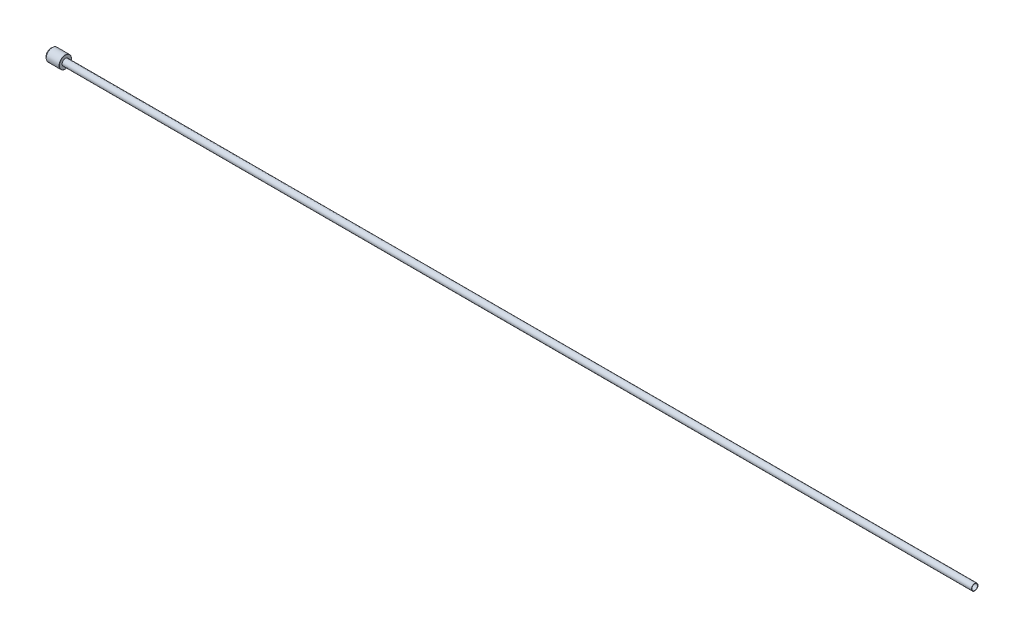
ISO-10303-21;
HEADER;
FILE_DESCRIPTION(('STEP AP214'),'2;1');
FILE_NAME('part.step','',(''),(''),'','','');
FILE_SCHEMA(('AUTOMOTIVE_DESIGN { 1 0 10303 214 1 1 1 1 }'));
ENDSEC;
DATA;
#1=APPLICATION_CONTEXT('core data for automotive mechanical design processes');
#2=APPLICATION_PROTOCOL_DEFINITION('international standard','automotive_design',2000,#1);
#3=PRODUCT_CONTEXT('',#1,'mechanical');
#4=PRODUCT('Part','Part','',(#3));
#5=PRODUCT_RELATED_PRODUCT_CATEGORY('part','',(#4));
#6=PRODUCT_DEFINITION_FORMATION('','',#4);
#7=PRODUCT_DEFINITION_CONTEXT('part definition',#1,'design');
#8=PRODUCT_DEFINITION('design','',#6,#7);
#9=PRODUCT_DEFINITION_SHAPE('','',#8);
#10=(LENGTH_UNIT() NAMED_UNIT(*) SI_UNIT(.MILLI.,.METRE.));
#11=(NAMED_UNIT(*) PLANE_ANGLE_UNIT() SI_UNIT($,.RADIAN.));
#12=(NAMED_UNIT(*) SI_UNIT($,.STERADIAN.) SOLID_ANGLE_UNIT());
#13=UNCERTAINTY_MEASURE_WITH_UNIT(LENGTH_MEASURE(1.E-05),#10,'distance_accuracy_value','');
#14=(GEOMETRIC_REPRESENTATION_CONTEXT(3) GLOBAL_UNCERTAINTY_ASSIGNED_CONTEXT((#13)) GLOBAL_UNIT_ASSIGNED_CONTEXT((#10,
#11,#12)) REPRESENTATION_CONTEXT('',''));
#15=CARTESIAN_POINT('',(0.,0.,0.));
#16=DIRECTION('',(0.,0.,1.));
#17=DIRECTION('',(1.,0.,0.));
#18=AXIS2_PLACEMENT_3D('',#15,#16,#17);
#19=CARTESIAN_POINT('',(7.,3.,0.));
#20=DIRECTION('',(-1.,0.,0.));
#21=DIRECTION('',(0.,0.,1.));
#22=AXIS2_PLACEMENT_3D('',#19,#20,#21);
#23=PLANE('',#22);
#24=CARTESIAN_POINT('',(7.,0.,0.));
#25=DIRECTION('',(-1.,0.,0.));
#26=DIRECTION('',(0.,0.,1.));
#27=AXIS2_PLACEMENT_3D('',#24,#25,#26);
#28=CIRCLE('',#27,2.9);
#29=CARTESIAN_POINT('',(7.,0.,2.9));
#30=VERTEX_POINT('',#29);
#31=EDGE_CURVE('E10',#30,#30,#28,.F.);
#32=ORIENTED_EDGE('',*,*,#31,.T.);
#33=EDGE_LOOP('',(#32));
#34=FACE_BOUND('',#33,.T.);
#35=CARTESIAN_POINT('',(7.,0.,0.));
#36=DIRECTION('',(-1.,0.,0.));
#37=DIRECTION('',(0.,0.,1.));
#38=AXIS2_PLACEMENT_3D('',#35,#36,#37);
#39=CIRCLE('',#38,1.5875);
#40=CARTESIAN_POINT('',(7.,0.,1.5875));
#41=VERTEX_POINT('',#40);
#42=EDGE_CURVE('E63',#41,#41,#39,.T.);
#43=ORIENTED_EDGE('',*,*,#42,.T.);
#44=EDGE_LOOP('',(#43));
#45=FACE_BOUND('',#44,.T.);
#46=ADVANCED_FACE('F31',(#34,#45),#23,.F.);
#47=CARTESIAN_POINT('',(-22.2121854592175,0.,0.));
#48=DIRECTION('',(-1.,0.,0.));
#49=DIRECTION('',(0.,0.,1.));
#50=AXIS2_PLACEMENT_3D('',#47,#48,#49);
#51=CYLINDRICAL_SURFACE('',#50,3.);
#52=CARTESIAN_POINT('',(6.9,0.,0.));
#53=DIRECTION('',(-1.,0.,0.));
#54=DIRECTION('',(0.,0.,1.));
#55=AXIS2_PLACEMENT_3D('',#52,#53,#54);
#56=CIRCLE('',#55,3.);
#57=CARTESIAN_POINT('',(6.9,0.,3.));
#58=VERTEX_POINT('',#57);
#59=EDGE_CURVE('E38',#58,#58,#56,.T.);
#60=ORIENTED_EDGE('',*,*,#59,.T.);
#61=EDGE_LOOP('',(#60));
#62=FACE_BOUND('',#61,.T.);
#63=CARTESIAN_POINT('',(0.659999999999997,0.,0.));
#64=DIRECTION('',(-1.,0.,0.));
#65=DIRECTION('',(0.,0.,1.));
#66=AXIS2_PLACEMENT_3D('',#63,#64,#65);
#67=CIRCLE('',#66,3.);
#68=CARTESIAN_POINT('',(0.659999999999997,0.,3.));
#69=VERTEX_POINT('',#68);
#70=EDGE_CURVE('E42',#69,#69,#67,.T.);
#71=ORIENTED_EDGE('',*,*,#70,.F.);
#72=EDGE_LOOP('',(#71));
#73=FACE_BOUND('',#72,.T.);
#74=ADVANCED_FACE('F101',(#62,#73),#51,.T.);
#75=CARTESIAN_POINT('',(0.659999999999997,0.,0.));
#76=DIRECTION('',(1.,0.,0.));
#77=DIRECTION('',(0.,0.,-1.));
#78=AXIS2_PLACEMENT_3D('',#75,#76,#77);
#79=CONICAL_SURFACE('',#78,3.,0.78539816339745);
#80=CARTESIAN_POINT('',(0.0999999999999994,0.,0.));
#81=DIRECTION('',(-1.,0.,0.));
#82=DIRECTION('',(0.,0.,1.));
#83=AXIS2_PLACEMENT_3D('',#80,#81,#82);
#84=CIRCLE('',#83,2.44);
#85=CARTESIAN_POINT('',(0.0999999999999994,0.,2.44));
#86=VERTEX_POINT('',#85);
#87=EDGE_CURVE('E46',#86,#86,#84,.T.);
#88=ORIENTED_EDGE('',*,*,#87,.F.);
#89=EDGE_LOOP('',(#88));
#90=FACE_BOUND('',#89,.T.);
#91=ORIENTED_EDGE('',*,*,#70,.T.);
#92=EDGE_LOOP('',(#91));
#93=FACE_BOUND('',#92,.T.);
#94=ADVANCED_FACE('F95',(#90,#93),#79,.T.);
#95=CARTESIAN_POINT('',(-22.2121854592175,0.,0.));
#96=DIRECTION('',(-1.,0.,0.));
#97=DIRECTION('',(0.,0.,1.));
#98=AXIS2_PLACEMENT_3D('',#95,#96,#97);
#99=CYLINDRICAL_SURFACE('',#98,2.44);
#100=CARTESIAN_POINT('',(0.,0.,0.));
#101=DIRECTION('',(-1.,0.,0.));
#102=DIRECTION('',(0.,0.,1.));
#103=AXIS2_PLACEMENT_3D('',#100,#101,#102);
#104=CIRCLE('',#103,2.44);
#105=CARTESIAN_POINT('',(0.,0.,2.44));
#106=VERTEX_POINT('',#105);
#107=EDGE_CURVE('E51',#106,#106,#104,.T.);
#108=ORIENTED_EDGE('',*,*,#107,.F.);
#109=EDGE_LOOP('',(#108));
#110=FACE_BOUND('',#109,.T.);
#111=ORIENTED_EDGE('',*,*,#87,.T.);
#112=EDGE_LOOP('',(#111));
#113=FACE_BOUND('',#112,.T.);
#114=ADVANCED_FACE('F89',(#110,#113),#99,.T.);
#115=CARTESIAN_POINT('',(0.,1.3843,0.));
#116=DIRECTION('',(1.,0.,0.));
#117=DIRECTION('',(0.,0.,-1.));
#118=AXIS2_PLACEMENT_3D('',#115,#116,#117);
#119=PLANE('',#118);
#120=CARTESIAN_POINT('',(0.,0.,0.));
#121=DIRECTION('',(-1.,0.,0.));
#122=DIRECTION('',(0.,0.,1.));
#123=AXIS2_PLACEMENT_3D('',#120,#121,#122);
#124=CIRCLE('',#123,1.3843);
#125=CARTESIAN_POINT('',(0.,0.,1.3843));
#126=VERTEX_POINT('',#125);
#127=EDGE_CURVE('E54',#126,#126,#124,.T.);
#128=ORIENTED_EDGE('',*,*,#127,.F.);
#129=EDGE_LOOP('',(#128));
#130=FACE_BOUND('',#129,.T.);
#131=ORIENTED_EDGE('',*,*,#107,.T.);
#132=EDGE_LOOP('',(#131));
#133=FACE_BOUND('',#132,.T.);
#134=ADVANCED_FACE('F83',(#130,#133),#119,.F.);
#135=CARTESIAN_POINT('',(-22.2121854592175,0.,0.));
#136=DIRECTION('',(-1.,0.,0.));
#137=DIRECTION('',(0.,0.,1.));
#138=AXIS2_PLACEMENT_3D('',#135,#136,#137);
#139=CYLINDRICAL_SURFACE('',#138,1.38430000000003);
#140=CARTESIAN_POINT('',(450.,0.,0.));
#141=DIRECTION('',(-1.,0.,0.));
#142=DIRECTION('',(0.,0.,1.));
#143=AXIS2_PLACEMENT_3D('',#140,#141,#142);
#144=CIRCLE('',#143,1.38430000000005);
#145=CARTESIAN_POINT('',(450.,0.,1.38430000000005));
#146=VERTEX_POINT('',#145);
#147=EDGE_CURVE('E57',#146,#146,#144,.T.);
#148=ORIENTED_EDGE('',*,*,#147,.F.);
#149=EDGE_LOOP('',(#148));
#150=FACE_BOUND('',#149,.T.);
#151=ORIENTED_EDGE('',*,*,#127,.T.);
#152=EDGE_LOOP('',(#151));
#153=FACE_BOUND('',#152,.T.);
#154=ADVANCED_FACE('F77',(#150,#153),#139,.F.);
#155=CARTESIAN_POINT('',(450.,1.5875,0.));
#156=DIRECTION('',(-1.,0.,0.));
#157=DIRECTION('',(0.,0.,1.));
#158=AXIS2_PLACEMENT_3D('',#155,#156,#157);
#159=PLANE('',#158);
#160=CARTESIAN_POINT('',(450.,0.,0.));
#161=DIRECTION('',(-1.,0.,0.));
#162=DIRECTION('',(0.,0.,1.));
#163=AXIS2_PLACEMENT_3D('',#160,#161,#162);
#164=CIRCLE('',#163,1.5875);
#165=CARTESIAN_POINT('',(450.,0.,1.5875));
#166=VERTEX_POINT('',#165);
#167=EDGE_CURVE('E60',#166,#166,#164,.T.);
#168=ORIENTED_EDGE('',*,*,#167,.F.);
#169=EDGE_LOOP('',(#168));
#170=FACE_BOUND('',#169,.T.);
#171=ORIENTED_EDGE('',*,*,#147,.T.);
#172=EDGE_LOOP('',(#171));
#173=FACE_BOUND('',#172,.T.);
#174=ADVANCED_FACE('F71',(#170,#173),#159,.F.);
#175=CARTESIAN_POINT('',(-22.2121854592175,0.,0.));
#176=DIRECTION('',(-1.,0.,0.));
#177=DIRECTION('',(0.,0.,1.));
#178=AXIS2_PLACEMENT_3D('',#175,#176,#177);
#179=CYLINDRICAL_SURFACE('',#178,1.5875);
#180=ORIENTED_EDGE('',*,*,#42,.F.);
#181=EDGE_LOOP('',(#180));
#182=FACE_BOUND('',#181,.T.);
#183=ORIENTED_EDGE('',*,*,#167,.T.);
#184=EDGE_LOOP('',(#183));
#185=FACE_BOUND('',#184,.T.);
#186=ADVANCED_FACE('F68',(#182,#185),#179,.T.);
#187=CARTESIAN_POINT('',(6.9,0.,0.));
#188=DIRECTION('',(-1.,0.,0.));
#189=DIRECTION('',(0.,0.,1.));
#190=AXIS2_PLACEMENT_3D('',#187,#188,#189);
#191=TOROIDAL_SURFACE('',#190,2.9,0.1);
#192=ORIENTED_EDGE('',*,*,#31,.F.);
#193=EDGE_LOOP('',(#192));
#194=FACE_BOUND('',#193,.T.);
#195=ORIENTED_EDGE('',*,*,#59,.F.);
#196=EDGE_LOOP('',(#195));
#197=FACE_BOUND('',#196,.T.);
#198=ADVANCED_FACE('F33',(#194,#197),#191,.T.);
#199=CLOSED_SHELL('',(#46,#74,#94,#114,#134,#154,#174,#186,#198));
#200=MANIFOLD_SOLID_BREP('B2',#199);
#201=ADVANCED_BREP_SHAPE_REPRESENTATION('',(#18,#200),#14);
#202=SHAPE_DEFINITION_REPRESENTATION(#9,#201);
ENDSEC;
END-ISO-10303-21;
